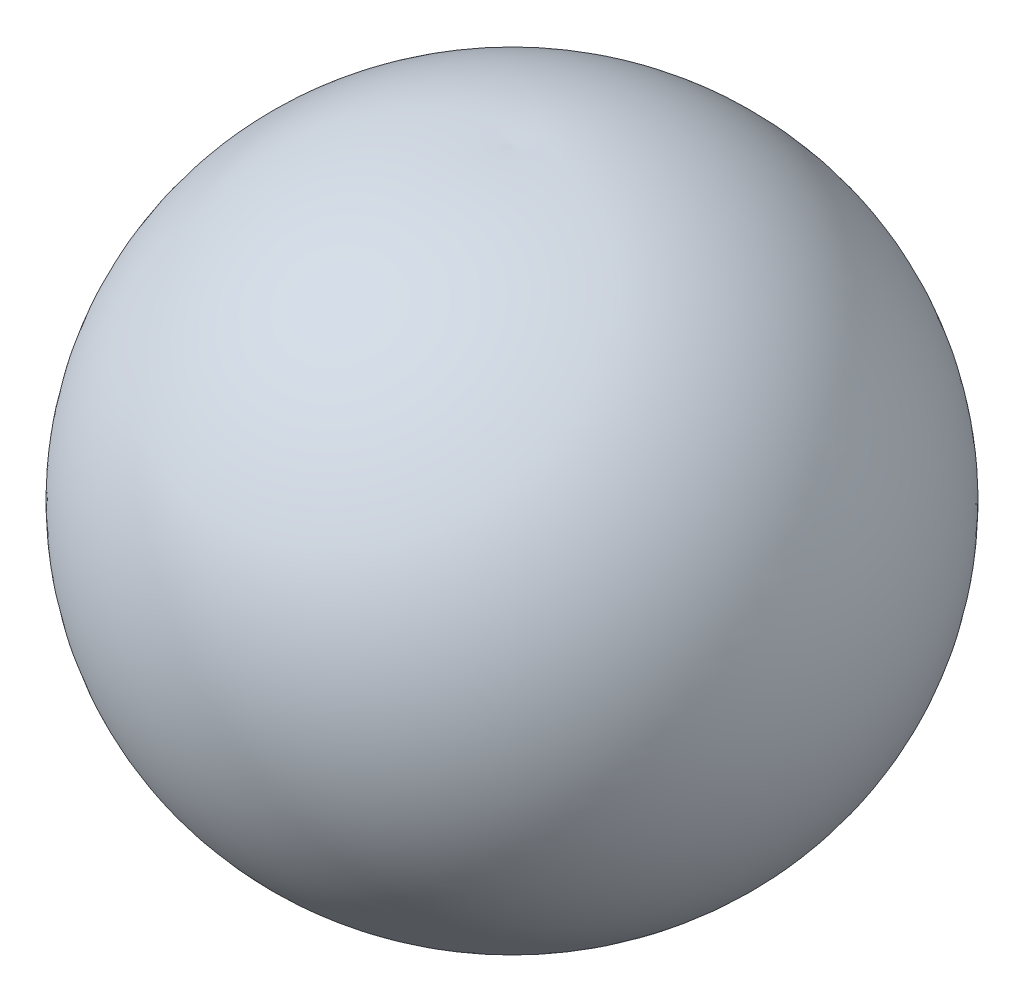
from build123d import *


with BuildPart() as part:
    # Sketch1 → Revolve1 (revolve)
    with BuildSketch(Plane.XY):
        with BuildLine():
            Line((0, 19), (0, 0))
            ThreePointArc((0, 0), (-10.136765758, 9.5), (0, 19))
        make_face()
    revolve(axis=Axis((0, 0, 0), (0, 1, 0)))


solid = part.part
